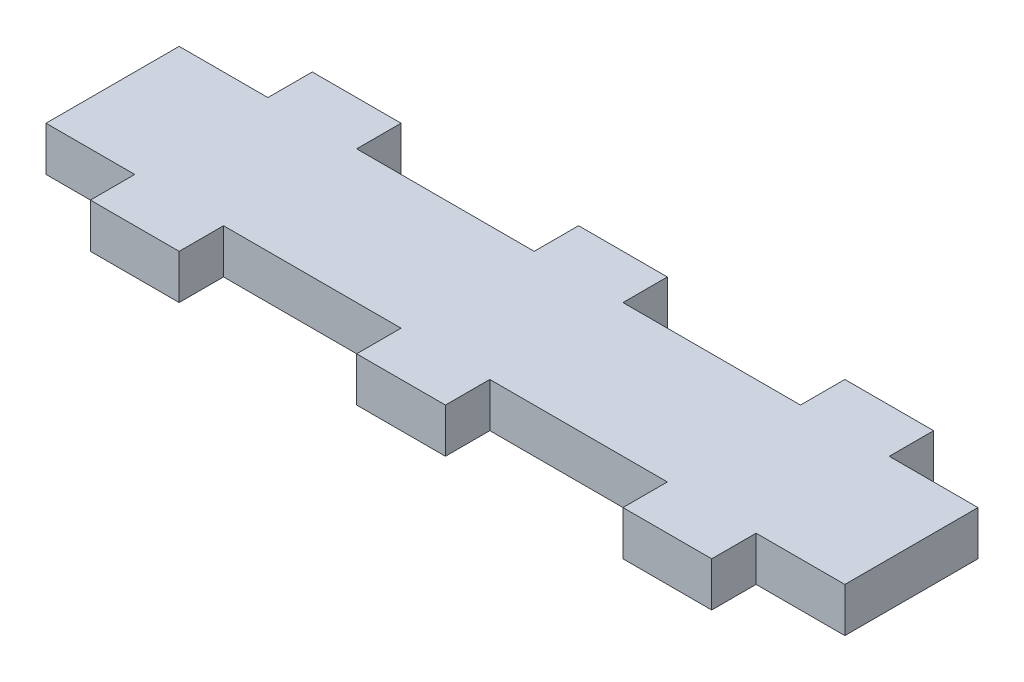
from build123d import *

# Parameters (mm, degrees)
SKETCH1_W           = 114.3
SKETCH1_H           = 19.05
BOSS_EXTRUDE1_DEPTH = 3.175
SKETCH2_W           = 12.7
SKETCH2_H           = 6.35
BOSS_EXTRUDE2_DEPTH = 6.35


with BuildPart() as part:
    # Sketch1 → Boss-Extrude1 (new, symmetric)
    with BuildSketch(Plane(origin=(0, 0, 0), x_dir=(1, 0, 0), z_dir=(0, 1, 0))):
        Rectangle(SKETCH1_W, SKETCH1_H)
    extrude(amount=BOSS_EXTRUDE1_DEPTH, both=True)

    # Sketch2 → Boss-Extrude2 (add)
    with BuildSketch(Plane(origin=(0, 3.175, 0), x_dir=(1, 0, 0), z_dir=(0, 1, 0))):
        with Locations((-38.1, 12.7)):
            Rectangle(SKETCH2_W, SKETCH2_H)
        with Locations((38.1, 12.7)):
            Rectangle(SKETCH2_W, SKETCH2_H)
        with Locations((0, 12.7)):
            Rectangle(SKETCH2_W, SKETCH2_H)
    boss_extrude2 = extrude(amount=-BOSS_EXTRUDE2_DEPTH)

    # Mirror1: Boss-Extrude2 across plane
    add(boss_extrude2.mirror(Plane.XY))


solid = part.part
